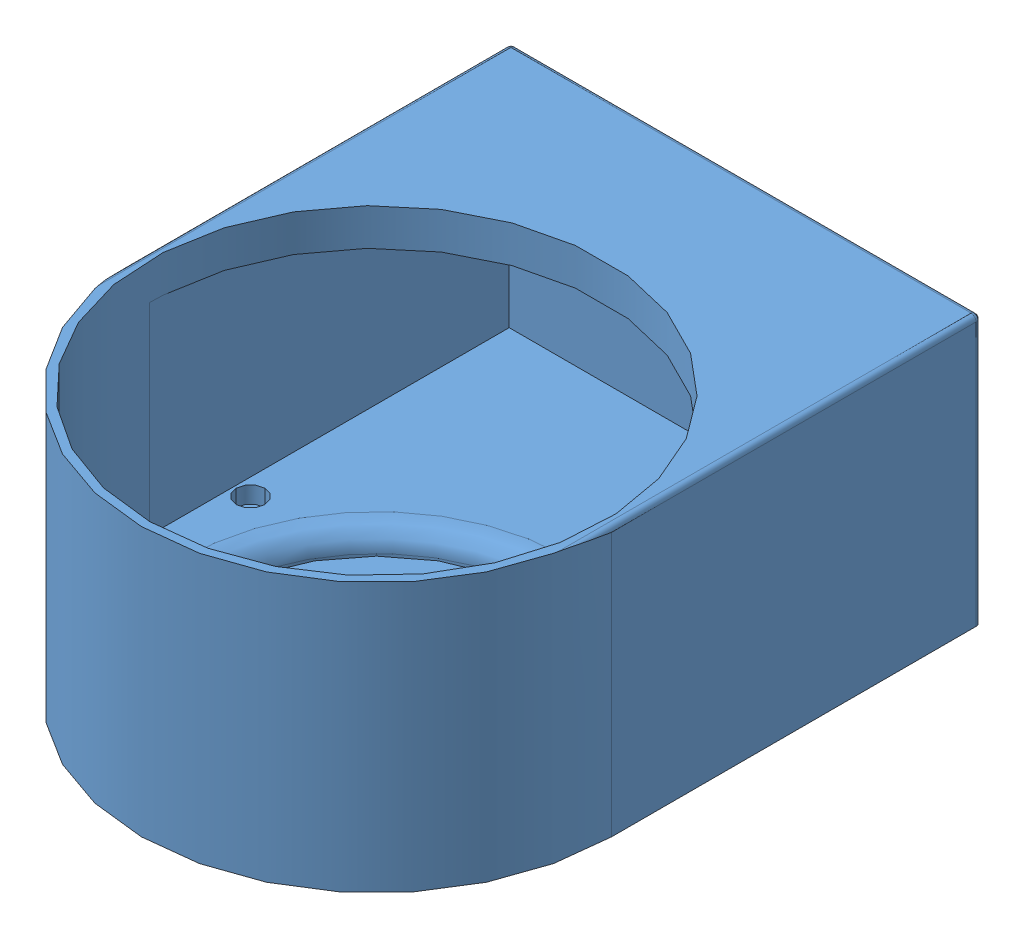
SolidWorks assembly B2647.SLDASM, configuration Default (file format 3100). Lengths in mm.
Overall size (280 160 360).
11 component instances, 3 part files, 0 mates.
Components (placement in the parent):
- B2123-1: B2123.sldprt [ShowingMount] at origin size (280 160 360)
- B1995-1: B1995.SLDASM [woLabels] at (-140 0 -220) x (0 0 1) z (0 1 0) size (239.39 157.62 264.32) (suppressed, hidden)
  - B1998-1: B1998.sldprt [X] x (0 0 -1) z (1 0 0) size (28.64 28.64 210)
  - B1998-2: B1998.sldprt [Y] x (0 0 1) z (0 1 0) size (28.64 28.64 110)
  - B1998-3: B1998.sldprt [Z] at origin size (28.64 28.64 260)
  - B1999-2: B1999.sldprt [100] at (0 0 197.2124) x (0 0 -1) z (0.268665 -0.963234 0) size (50 78.75 105)
- B1995-2: B1995.SLDASM [woLabels] at (0 346 0) x (0 0 1) z (0 1 0) size (239.39 157.62 264.32) (suppressed, hidden)
  - B1998-1: B1998.sldprt [X] x (0 0 -1) z (1 0 0) size (28.64 28.64 210)
  - B1998-2: B1998.sldprt [Y] x (0 0 1) z (0 1 0) size (28.64 28.64 110)
  - B1998-3: B1998.sldprt [Z] at origin size (28.64 28.64 260)
  - B1999-2: B1999.sldprt [100] at (0 0 197.2124) x (0 0 -1) z (0.268665 -0.963234 0) size (50 78.75 105)
